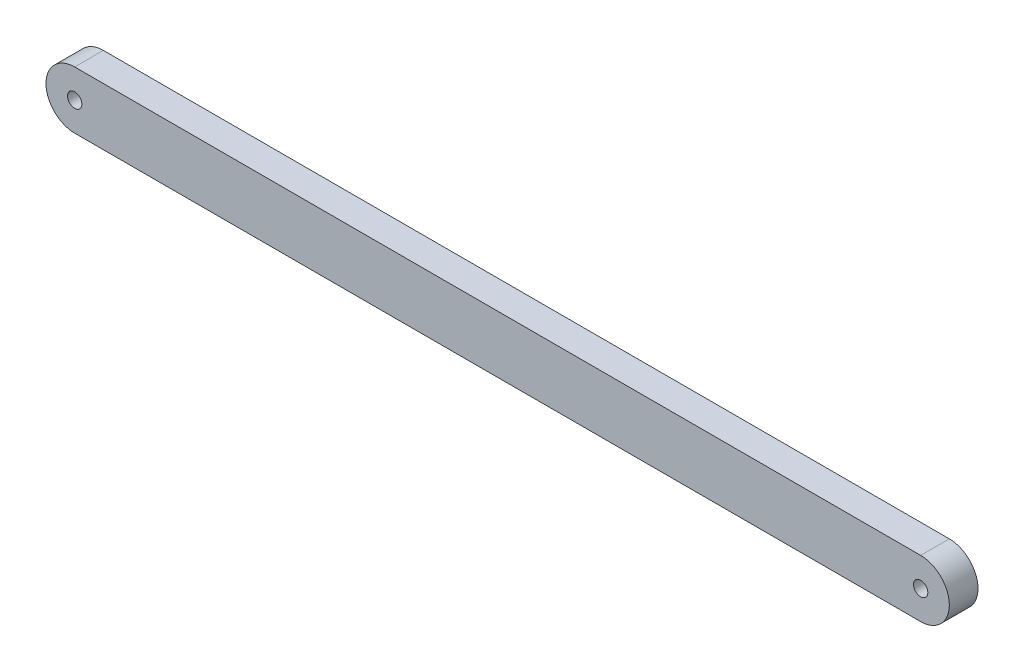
ISO-10303-21;
HEADER;
FILE_DESCRIPTION(('STEP AP214'),'2;1');
FILE_NAME('part.step','',(''),(''),'','','');
FILE_SCHEMA(('AUTOMOTIVE_DESIGN { 1 0 10303 214 1 1 1 1 }'));
ENDSEC;
DATA;
#1=APPLICATION_CONTEXT('core data for automotive mechanical design processes');
#2=APPLICATION_PROTOCOL_DEFINITION('international standard','automotive_design',2000,#1);
#3=PRODUCT_CONTEXT('',#1,'mechanical');
#4=PRODUCT('Part','Part','',(#3));
#5=PRODUCT_RELATED_PRODUCT_CATEGORY('part','',(#4));
#6=PRODUCT_DEFINITION_FORMATION('','',#4);
#7=PRODUCT_DEFINITION_CONTEXT('part definition',#1,'design');
#8=PRODUCT_DEFINITION('design','',#6,#7);
#9=PRODUCT_DEFINITION_SHAPE('','',#8);
#10=(LENGTH_UNIT() NAMED_UNIT(*) SI_UNIT(.MILLI.,.METRE.));
#11=(NAMED_UNIT(*) PLANE_ANGLE_UNIT() SI_UNIT($,.RADIAN.));
#12=(NAMED_UNIT(*) SI_UNIT($,.STERADIAN.) SOLID_ANGLE_UNIT());
#13=UNCERTAINTY_MEASURE_WITH_UNIT(LENGTH_MEASURE(1.E-05),#10,'distance_accuracy_value','');
#14=(GEOMETRIC_REPRESENTATION_CONTEXT(3) GLOBAL_UNCERTAINTY_ASSIGNED_CONTEXT((#13)) GLOBAL_UNIT_ASSIGNED_CONTEXT((#10,
#11,#12)) REPRESENTATION_CONTEXT('',''));
#15=CARTESIAN_POINT('',(0.,0.,0.));
#16=DIRECTION('',(0.,0.,1.));
#17=DIRECTION('',(1.,0.,0.));
#18=AXIS2_PLACEMENT_3D('',#15,#16,#17);
#19=CARTESIAN_POINT('',(0.,0.,2.54));
#20=DIRECTION('',(0.,0.,-1.));
#21=DIRECTION('',(-1.,0.,0.));
#22=AXIS2_PLACEMENT_3D('',#19,#20,#21);
#23=CYLINDRICAL_SURFACE('',#22,2.54);
#24=CARTESIAN_POINT('',(0.,0.,0.));
#25=DIRECTION('',(0.,0.,1.));
#26=DIRECTION('',(1.,0.,0.));
#27=AXIS2_PLACEMENT_3D('',#24,#25,#26);
#28=CIRCLE('',#27,2.54);
#29=CARTESIAN_POINT('',(0.,2.54,0.));
#30=VERTEX_POINT('',#29);
#31=CARTESIAN_POINT('',(0.,-2.54,0.));
#32=VERTEX_POINT('',#31);
#33=EDGE_CURVE('E95',#30,#32,#28,.T.);
#34=ORIENTED_EDGE('',*,*,#33,.T.);
#35=DIRECTION('',(0.,0.,-1.));
#36=VECTOR('',#35,1.);
#37=CARTESIAN_POINT('',(0.,-2.54,2.54));
#38=LINE('',#37,#36);
#39=CARTESIAN_POINT('',(0.,-2.54,2.54));
#40=VERTEX_POINT('',#39);
#41=EDGE_CURVE('E11',#40,#32,#38,.T.);
#42=ORIENTED_EDGE('',*,*,#41,.F.);
#43=CARTESIAN_POINT('',(0.,0.,2.54));
#44=DIRECTION('',(0.,0.,1.));
#45=DIRECTION('',(1.,0.,0.));
#46=AXIS2_PLACEMENT_3D('',#43,#44,#45);
#47=CIRCLE('',#46,2.54);
#48=CARTESIAN_POINT('',(0.,2.54,2.54));
#49=VERTEX_POINT('',#48);
#50=EDGE_CURVE('E83',#49,#40,#47,.T.);
#51=ORIENTED_EDGE('',*,*,#50,.F.);
#52=DIRECTION('',(0.,0.,-1.));
#53=VECTOR('',#52,1.);
#54=CARTESIAN_POINT('',(0.,2.54,2.54));
#55=LINE('',#54,#53);
#56=EDGE_CURVE('E91',#49,#30,#55,.T.);
#57=ORIENTED_EDGE('',*,*,#56,.T.);
#58=EDGE_LOOP('',(#34,#42,#51,#57));
#59=FACE_BOUND('',#58,.T.);
#60=ADVANCED_FACE('F32',(#59),#23,.T.);
#61=CARTESIAN_POINT('',(0.,-2.54,2.54));
#62=DIRECTION('',(0.,1.,0.));
#63=DIRECTION('',(0.,0.,1.));
#64=AXIS2_PLACEMENT_3D('',#61,#62,#63);
#65=PLANE('',#64);
#66=DIRECTION('',(1.,0.,0.));
#67=VECTOR('',#66,1.);
#68=CARTESIAN_POINT('',(0.,-2.54,0.));
#69=LINE('',#68,#67);
#70=CARTESIAN_POINT('',(74.93,-2.54,0.));
#71=VERTEX_POINT('',#70);
#72=EDGE_CURVE('E87',#32,#71,#69,.T.);
#73=ORIENTED_EDGE('',*,*,#72,.T.);
#74=DIRECTION('',(0.,0.,-1.));
#75=VECTOR('',#74,1.);
#76=CARTESIAN_POINT('',(74.93,-2.54,2.54));
#77=LINE('',#76,#75);
#78=CARTESIAN_POINT('',(74.93,-2.54,2.54));
#79=VERTEX_POINT('',#78);
#80=EDGE_CURVE('E40',#79,#71,#77,.T.);
#81=ORIENTED_EDGE('',*,*,#80,.F.);
#82=DIRECTION('',(1.,0.,0.));
#83=VECTOR('',#82,1.);
#84=CARTESIAN_POINT('',(0.,-2.54,2.54));
#85=LINE('',#84,#83);
#86=EDGE_CURVE('E78',#40,#79,#85,.T.);
#87=ORIENTED_EDGE('',*,*,#86,.F.);
#88=ORIENTED_EDGE('',*,*,#41,.T.);
#89=EDGE_LOOP('',(#73,#81,#87,#88));
#90=FACE_BOUND('',#89,.T.);
#91=ADVANCED_FACE('F86',(#90),#65,.F.);
#92=CARTESIAN_POINT('',(74.93,0.,2.54));
#93=DIRECTION('',(0.,0.,-1.));
#94=DIRECTION('',(-1.,0.,0.));
#95=AXIS2_PLACEMENT_3D('',#92,#93,#94);
#96=CYLINDRICAL_SURFACE('',#95,2.54);
#97=CARTESIAN_POINT('',(74.93,0.,0.));
#98=DIRECTION('',(0.,0.,1.));
#99=DIRECTION('',(1.,0.,0.));
#100=AXIS2_PLACEMENT_3D('',#97,#98,#99);
#101=CIRCLE('',#100,2.54);
#102=CARTESIAN_POINT('',(74.93,2.54,0.));
#103=VERTEX_POINT('',#102);
#104=EDGE_CURVE('E65',#71,#103,#101,.T.);
#105=ORIENTED_EDGE('',*,*,#104,.T.);
#106=DIRECTION('',(0.,0.,-1.));
#107=VECTOR('',#106,1.);
#108=CARTESIAN_POINT('',(74.93,2.54,2.54));
#109=LINE('',#108,#107);
#110=CARTESIAN_POINT('',(74.93,2.54,2.54));
#111=VERTEX_POINT('',#110);
#112=EDGE_CURVE('E88',#111,#103,#109,.T.);
#113=ORIENTED_EDGE('',*,*,#112,.F.);
#114=CARTESIAN_POINT('',(74.93,0.,2.54));
#115=DIRECTION('',(0.,0.,1.));
#116=DIRECTION('',(1.,0.,0.));
#117=AXIS2_PLACEMENT_3D('',#114,#115,#116);
#118=CIRCLE('',#117,2.54);
#119=EDGE_CURVE('E81',#79,#111,#118,.T.);
#120=ORIENTED_EDGE('',*,*,#119,.F.);
#121=ORIENTED_EDGE('',*,*,#80,.T.);
#122=EDGE_LOOP('',(#105,#113,#120,#121));
#123=FACE_BOUND('',#122,.T.);
#124=ADVANCED_FACE('F89',(#123),#96,.T.);
#125=CARTESIAN_POINT('',(0.,2.54,2.54));
#126=DIRECTION('',(0.,-1.,0.));
#127=DIRECTION('',(0.,0.,-1.));
#128=AXIS2_PLACEMENT_3D('',#125,#126,#127);
#129=PLANE('',#128);
#130=DIRECTION('',(-1.,0.,0.));
#131=VECTOR('',#130,1.);
#132=CARTESIAN_POINT('',(0.,2.54,0.));
#133=LINE('',#132,#131);
#134=EDGE_CURVE('E71',#103,#30,#133,.T.);
#135=ORIENTED_EDGE('',*,*,#134,.T.);
#136=ORIENTED_EDGE('',*,*,#56,.F.);
#137=DIRECTION('',(-1.,0.,0.));
#138=VECTOR('',#137,1.);
#139=CARTESIAN_POINT('',(0.,2.54,2.54));
#140=LINE('',#139,#138);
#141=EDGE_CURVE('E48',#111,#49,#140,.T.);
#142=ORIENTED_EDGE('',*,*,#141,.F.);
#143=ORIENTED_EDGE('',*,*,#112,.T.);
#144=EDGE_LOOP('',(#135,#136,#142,#143));
#145=FACE_BOUND('',#144,.T.);
#146=ADVANCED_FACE('F103',(#145),#129,.F.);
#147=CARTESIAN_POINT('',(0.,0.,2.54));
#148=DIRECTION('',(0.,0.,1.));
#149=DIRECTION('',(1.,0.,0.));
#150=AXIS2_PLACEMENT_3D('',#147,#148,#149);
#151=PLANE('',#150);
#152=CARTESIAN_POINT('',(74.93,0.,2.54));
#153=DIRECTION('',(0.,0.,1.));
#154=DIRECTION('',(1.,0.,0.));
#155=AXIS2_PLACEMENT_3D('',#152,#153,#154);
#156=CIRCLE('',#155,0.635);
#157=CARTESIAN_POINT('',(75.565,0.,2.54));
#158=VERTEX_POINT('',#157);
#159=EDGE_CURVE('E114',#158,#158,#156,.F.);
#160=ORIENTED_EDGE('',*,*,#159,.T.);
#161=EDGE_LOOP('',(#160));
#162=FACE_BOUND('',#161,.T.);
#163=CARTESIAN_POINT('',(0.,0.,2.54));
#164=DIRECTION('',(0.,0.,1.));
#165=DIRECTION('',(1.,0.,0.));
#166=AXIS2_PLACEMENT_3D('',#163,#164,#165);
#167=CIRCLE('',#166,0.635);
#168=CARTESIAN_POINT('',(0.635,0.,2.54));
#169=VERTEX_POINT('',#168);
#170=EDGE_CURVE('E98',#169,#169,#167,.T.);
#171=ORIENTED_EDGE('',*,*,#170,.F.);
#172=EDGE_LOOP('',(#171));
#173=FACE_BOUND('',#172,.T.);
#174=ORIENTED_EDGE('',*,*,#50,.T.);
#175=ORIENTED_EDGE('',*,*,#86,.T.);
#176=ORIENTED_EDGE('',*,*,#119,.T.);
#177=ORIENTED_EDGE('',*,*,#141,.T.);
#178=EDGE_LOOP('',(#174,#175,#176,#177));
#179=FACE_BOUND('',#178,.T.);
#180=ADVANCED_FACE('F79',(#162,#173,#179),#151,.T.);
#181=CARTESIAN_POINT('',(0.,0.,0.));
#182=DIRECTION('',(0.,0.,1.));
#183=DIRECTION('',(1.,0.,0.));
#184=AXIS2_PLACEMENT_3D('',#181,#182,#183);
#185=PLANE('',#184);
#186=CARTESIAN_POINT('',(74.93,0.,0.));
#187=DIRECTION('',(0.,0.,-1.));
#188=DIRECTION('',(-1.,0.,0.));
#189=AXIS2_PLACEMENT_3D('',#186,#187,#188);
#190=CIRCLE('',#189,0.635);
#191=CARTESIAN_POINT('',(74.295,0.,0.));
#192=VERTEX_POINT('',#191);
#193=EDGE_CURVE('E117',#192,#192,#190,.T.);
#194=ORIENTED_EDGE('',*,*,#193,.F.);
#195=EDGE_LOOP('',(#194));
#196=FACE_BOUND('',#195,.T.);
#197=CARTESIAN_POINT('',(0.,0.,0.));
#198=DIRECTION('',(0.,0.,1.));
#199=DIRECTION('',(1.,0.,0.));
#200=AXIS2_PLACEMENT_3D('',#197,#198,#199);
#201=CIRCLE('',#200,0.635);
#202=CARTESIAN_POINT('',(0.635,0.,0.));
#203=VERTEX_POINT('',#202);
#204=EDGE_CURVE('E111',#203,#203,#201,.T.);
#205=ORIENTED_EDGE('',*,*,#204,.T.);
#206=EDGE_LOOP('',(#205));
#207=FACE_BOUND('',#206,.T.);
#208=ORIENTED_EDGE('',*,*,#33,.F.);
#209=ORIENTED_EDGE('',*,*,#134,.F.);
#210=ORIENTED_EDGE('',*,*,#104,.F.);
#211=ORIENTED_EDGE('',*,*,#72,.F.);
#212=EDGE_LOOP('',(#208,#209,#210,#211));
#213=FACE_BOUND('',#212,.T.);
#214=ADVANCED_FACE('F106',(#196,#207,#213),#185,.F.);
#215=CARTESIAN_POINT('',(0.,0.,0.));
#216=DIRECTION('',(0.,0.,1.));
#217=DIRECTION('',(1.,0.,0.));
#218=AXIS2_PLACEMENT_3D('',#215,#216,#217);
#219=CYLINDRICAL_SURFACE('',#218,0.635);
#220=ORIENTED_EDGE('',*,*,#170,.T.);
#221=EDGE_LOOP('',(#220));
#222=FACE_BOUND('',#221,.T.);
#223=ORIENTED_EDGE('',*,*,#204,.F.);
#224=EDGE_LOOP('',(#223));
#225=FACE_BOUND('',#224,.T.);
#226=ADVANCED_FACE('F125',(#222,#225),#219,.F.);
#227=CARTESIAN_POINT('',(74.93,0.,0.));
#228=DIRECTION('',(0.,0.,1.));
#229=DIRECTION('',(1.,0.,0.));
#230=AXIS2_PLACEMENT_3D('',#227,#228,#229);
#231=CYLINDRICAL_SURFACE('',#230,0.635);
#232=ORIENTED_EDGE('',*,*,#159,.F.);
#233=EDGE_LOOP('',(#232));
#234=FACE_BOUND('',#233,.T.);
#235=ORIENTED_EDGE('',*,*,#193,.T.);
#236=EDGE_LOOP('',(#235));
#237=FACE_BOUND('',#236,.T.);
#238=ADVANCED_FACE('F121',(#234,#237),#231,.F.);
#239=CLOSED_SHELL('',(#60,#91,#124,#146,#180,#214,#226,#238));
#240=MANIFOLD_SOLID_BREP('B2',#239);
#241=ADVANCED_BREP_SHAPE_REPRESENTATION('',(#18,#240),#14);
#242=SHAPE_DEFINITION_REPRESENTATION(#9,#241);
ENDSEC;
END-ISO-10303-21;
